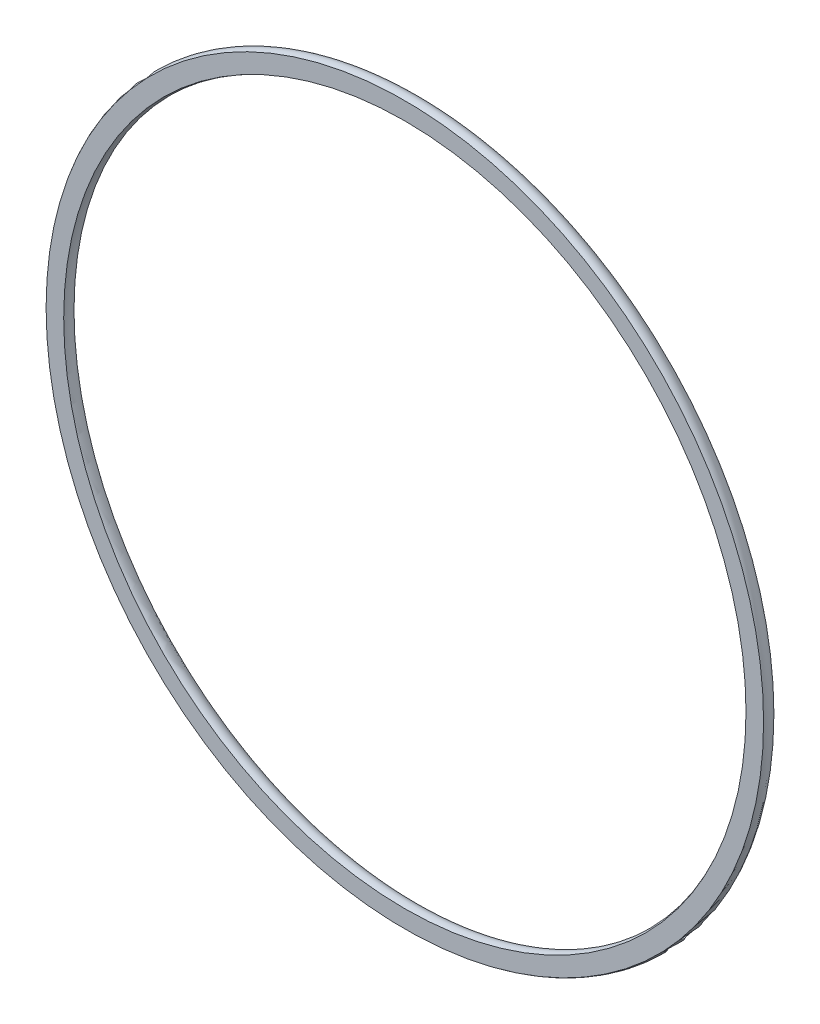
from build123d import *

# Parameters (mm, degrees)
SKETCH1_R          = 0.889
SKETCH2_W          = 80.635614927
SKETCH2_H          = 72.221835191
CUT_EXTRUDE1_DEPTH = 0.4572


with BuildPart() as part:
    # Sketch1 → Revolve1 (revolve)
    with BuildSketch(Plane(origin=(0, 0, 0), x_dir=(0, -1, 0), z_dir=(1, 0, 0)), mode=Mode.PRIVATE) as revolve1_sk:
        with Locations((30.9118, 0)):
            Circle(SKETCH1_R)
    revolve(revolve1_sk.sketch.rotate(Axis((0, 0, 0.889), (0, 0, -1)), 270), axis=Axis((0, 0, 0.889), (0, 0, -1)))

    # Sketch2 → Cut-Extrude1 (cut)
    with BuildSketch(Plane.XY.offset(0.889)):
        with Locations((0.982319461, -0.149483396)):
            Rectangle(SKETCH2_W, SKETCH2_H)
    extrude(amount=-CUT_EXTRUDE1_DEPTH, mode=Mode.SUBTRACT)


solid = part.part
